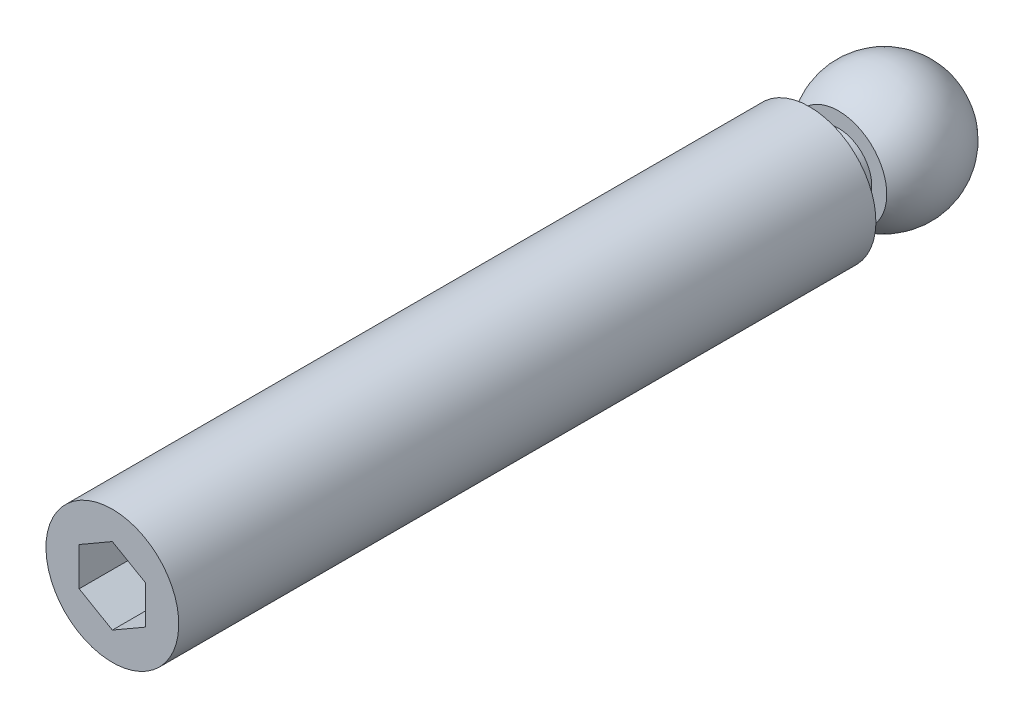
ISO-10303-21;
HEADER;
FILE_DESCRIPTION(('STEP AP214'),'2;1');
FILE_NAME('part.step','',(''),(''),'','','');
FILE_SCHEMA(('AUTOMOTIVE_DESIGN { 1 0 10303 214 1 1 1 1 }'));
ENDSEC;
DATA;
#1=APPLICATION_CONTEXT('core data for automotive mechanical design processes');
#2=APPLICATION_PROTOCOL_DEFINITION('international standard','automotive_design',2000,#1);
#3=PRODUCT_CONTEXT('',#1,'mechanical');
#4=PRODUCT('Part','Part','',(#3));
#5=PRODUCT_RELATED_PRODUCT_CATEGORY('part','',(#4));
#6=PRODUCT_DEFINITION_FORMATION('','',#4);
#7=PRODUCT_DEFINITION_CONTEXT('part definition',#1,'design');
#8=PRODUCT_DEFINITION('design','',#6,#7);
#9=PRODUCT_DEFINITION_SHAPE('','',#8);
#10=(LENGTH_UNIT() NAMED_UNIT(*) SI_UNIT(.MILLI.,.METRE.));
#11=(NAMED_UNIT(*) PLANE_ANGLE_UNIT() SI_UNIT($,.RADIAN.));
#12=(NAMED_UNIT(*) SI_UNIT($,.STERADIAN.) SOLID_ANGLE_UNIT());
#13=UNCERTAINTY_MEASURE_WITH_UNIT(LENGTH_MEASURE(1.E-05),#10,'distance_accuracy_value','');
#14=(GEOMETRIC_REPRESENTATION_CONTEXT(3) GLOBAL_UNCERTAINTY_ASSIGNED_CONTEXT((#13)) GLOBAL_UNIT_ASSIGNED_CONTEXT((#10,
#11,#12)) REPRESENTATION_CONTEXT('',''));
#15=CARTESIAN_POINT('',(0.,0.,0.));
#16=DIRECTION('',(0.,0.,1.));
#17=DIRECTION('',(1.,0.,0.));
#18=AXIS2_PLACEMENT_3D('',#15,#16,#17);
#19=CARTESIAN_POINT('',(0.,0.,8.));
#20=DIRECTION('',(0.,-1.,0.));
#21=DIRECTION('',(-1.,0.,0.));
#22=AXIS2_PLACEMENT_3D('',#19,#20,#21);
#23=SPHERICAL_SURFACE('',#22,8.);
#24=CARTESIAN_POINT('',(0.,0.,8.));
#25=DIRECTION('',(0.,0.,1.));
#26=DIRECTION('',(0.,1.,0.));
#27=AXIS2_PLACEMENT_3D('',#24,#25,#26);
#28=SPHERICAL_SURFACE('',#27,8.);
#29=CARTESIAN_POINT('',(0.,0.,13.5));
#30=DIRECTION('',(0.,0.,1.));
#31=DIRECTION('',(0.,1.,0.));
#32=AXIS2_PLACEMENT_3D('',#29,#30,#31);
#33=CIRCLE('',#32,5.80947501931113);
#34=CARTESIAN_POINT('',(0.,5.80947501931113,13.5));
#35=VERTEX_POINT('',#34);
#36=EDGE_CURVE('E9',#35,#35,#33,.T.);
#37=ORIENTED_EDGE('',*,*,#36,.F.);
#38=EDGE_LOOP('',(#37));
#39=FACE_BOUND('',#38,.T.);
#40=ADVANCED_FACE('F14',(#39),#28,.T.);
#41=CARTESIAN_POINT('',(0.,-5.80947501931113,13.5));
#42=DIRECTION('',(0.,0.,-1.));
#43=DIRECTION('',(0.,-1.,0.));
#44=AXIS2_PLACEMENT_3D('',#41,#42,#43);
#45=PLANE('',#44);
#46=CARTESIAN_POINT('',(0.,0.,13.5));
#47=DIRECTION('',(0.,0.,1.));
#48=DIRECTION('',(0.,1.,0.));
#49=AXIS2_PLACEMENT_3D('',#46,#47,#48);
#50=CIRCLE('',#49,4.);
#51=CARTESIAN_POINT('',(0.,4.,13.5));
#52=VERTEX_POINT('',#51);
#53=EDGE_CURVE('E21',#52,#52,#50,.T.);
#54=ORIENTED_EDGE('',*,*,#53,.F.);
#55=EDGE_LOOP('',(#54));
#56=FACE_BOUND('',#55,.T.);
#57=ORIENTED_EDGE('',*,*,#36,.T.);
#58=EDGE_LOOP('',(#57));
#59=FACE_BOUND('',#58,.T.);
#60=ADVANCED_FACE('F134',(#56,#59),#45,.F.);
#61=CARTESIAN_POINT('',(0.,0.,8.3));
#62=DIRECTION('',(0.,0.,1.));
#63=DIRECTION('',(0.,1.,0.));
#64=AXIS2_PLACEMENT_3D('',#61,#62,#63);
#65=CYLINDRICAL_SURFACE('',#64,4.);
#66=ORIENTED_EDGE('',*,*,#53,.T.);
#67=EDGE_LOOP('',(#66));
#68=FACE_BOUND('',#67,.T.);
#69=CARTESIAN_POINT('',(0.,0.,17.));
#70=DIRECTION('',(0.,0.,1.));
#71=DIRECTION('',(0.,1.,0.));
#72=AXIS2_PLACEMENT_3D('',#69,#70,#71);
#73=CIRCLE('',#72,4.);
#74=CARTESIAN_POINT('',(0.,4.,17.));
#75=VERTEX_POINT('',#74);
#76=EDGE_CURVE('E126',#75,#75,#73,.T.);
#77=ORIENTED_EDGE('',*,*,#76,.F.);
#78=EDGE_LOOP('',(#77));
#79=FACE_BOUND('',#78,.T.);
#80=ADVANCED_FACE('F131',(#68,#79),#65,.T.);
#81=CARTESIAN_POINT('',(0.,-8.,17.));
#82=DIRECTION('',(0.,0.,-1.));
#83=DIRECTION('',(0.,-1.,0.));
#84=AXIS2_PLACEMENT_3D('',#81,#82,#83);
#85=PLANE('',#84);
#86=ORIENTED_EDGE('',*,*,#76,.T.);
#87=EDGE_LOOP('',(#86));
#88=FACE_BOUND('',#87,.T.);
#89=CARTESIAN_POINT('',(0.,0.,17.));
#90=DIRECTION('',(0.,0.,1.));
#91=DIRECTION('',(0.,1.,0.));
#92=AXIS2_PLACEMENT_3D('',#89,#90,#91);
#93=CIRCLE('',#92,8.);
#94=CARTESIAN_POINT('',(0.,8.,17.));
#95=VERTEX_POINT('',#94);
#96=EDGE_CURVE('E123',#95,#95,#93,.T.);
#97=ORIENTED_EDGE('',*,*,#96,.F.);
#98=EDGE_LOOP('',(#97));
#99=FACE_BOUND('',#98,.T.);
#100=ADVANCED_FACE('F157',(#88,#99),#85,.T.);
#101=CARTESIAN_POINT('',(0.,0.,8.3));
#102=DIRECTION('',(0.,0.,1.));
#103=DIRECTION('',(0.,1.,0.));
#104=AXIS2_PLACEMENT_3D('',#101,#102,#103);
#105=CYLINDRICAL_SURFACE('',#104,8.);
#106=ORIENTED_EDGE('',*,*,#96,.T.);
#107=EDGE_LOOP('',(#106));
#108=FACE_BOUND('',#107,.T.);
#109=CARTESIAN_POINT('',(0.,0.,101.));
#110=DIRECTION('',(0.,0.,1.));
#111=DIRECTION('',(0.,1.,0.));
#112=AXIS2_PLACEMENT_3D('',#109,#110,#111);
#113=CIRCLE('',#112,8.);
#114=CARTESIAN_POINT('',(0.,8.,101.));
#115=VERTEX_POINT('',#114);
#116=EDGE_CURVE('E115',#115,#115,#113,.T.);
#117=ORIENTED_EDGE('',*,*,#116,.F.);
#118=EDGE_LOOP('',(#117));
#119=FACE_BOUND('',#118,.T.);
#120=ADVANCED_FACE('F165',(#108,#119),#105,.T.);
#121=CARTESIAN_POINT('',(0.,0.,101.));
#122=DIRECTION('',(0.,0.,1.));
#123=DIRECTION('',(0.,1.,0.));
#124=AXIS2_PLACEMENT_3D('',#121,#122,#123);
#125=PLANE('',#124);
#126=DIRECTION('',(-0.866025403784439,0.5,0.));
#127=VECTOR('',#126,1.);
#128=CARTESIAN_POINT('',(4.,2.30940107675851,101.));
#129=LINE('',#128,#127);
#130=CARTESIAN_POINT('',(4.,2.30940107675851,101.));
#131=VERTEX_POINT('',#130);
#132=CARTESIAN_POINT('',(0.,4.61880215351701,101.));
#133=VERTEX_POINT('',#132);
#134=EDGE_CURVE('E28',#131,#133,#129,.T.);
#135=ORIENTED_EDGE('',*,*,#134,.F.);
#136=DIRECTION('',(0.,1.,0.));
#137=VECTOR('',#136,1.);
#138=CARTESIAN_POINT('',(4.,-2.30940107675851,101.));
#139=LINE('',#138,#137);
#140=CARTESIAN_POINT('',(4.,-2.30940107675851,101.));
#141=VERTEX_POINT('',#140);
#142=EDGE_CURVE('E111',#141,#131,#139,.T.);
#143=ORIENTED_EDGE('',*,*,#142,.F.);
#144=DIRECTION('',(0.866025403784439,0.5,0.));
#145=VECTOR('',#144,1.);
#146=CARTESIAN_POINT('',(0.,-4.61880215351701,101.));
#147=LINE('',#146,#145);
#148=CARTESIAN_POINT('',(0.,-4.61880215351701,101.));
#149=VERTEX_POINT('',#148);
#150=EDGE_CURVE('E109',#149,#141,#147,.T.);
#151=ORIENTED_EDGE('',*,*,#150,.F.);
#152=DIRECTION('',(0.866025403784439,-0.5,0.));
#153=VECTOR('',#152,1.);
#154=CARTESIAN_POINT('',(-4.,-2.30940107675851,101.));
#155=LINE('',#154,#153);
#156=CARTESIAN_POINT('',(-4.,-2.30940107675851,101.));
#157=VERTEX_POINT('',#156);
#158=EDGE_CURVE('E76',#157,#149,#155,.T.);
#159=ORIENTED_EDGE('',*,*,#158,.F.);
#160=DIRECTION('',(0.,-1.,0.));
#161=VECTOR('',#160,1.);
#162=CARTESIAN_POINT('',(-4.,2.30940107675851,101.));
#163=LINE('',#162,#161);
#164=CARTESIAN_POINT('',(-4.,2.30940107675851,101.));
#165=VERTEX_POINT('',#164);
#166=EDGE_CURVE('E105',#165,#157,#163,.T.);
#167=ORIENTED_EDGE('',*,*,#166,.F.);
#168=DIRECTION('',(-0.866025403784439,-0.5,0.));
#169=VECTOR('',#168,1.);
#170=CARTESIAN_POINT('',(0.,4.61880215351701,101.));
#171=LINE('',#170,#169);
#172=EDGE_CURVE('E102',#133,#165,#171,.T.);
#173=ORIENTED_EDGE('',*,*,#172,.F.);
#174=EDGE_LOOP('',(#135,#143,#151,#159,#167,#173));
#175=FACE_BOUND('',#174,.T.);
#176=ORIENTED_EDGE('',*,*,#116,.T.);
#177=EDGE_LOOP('',(#176));
#178=FACE_BOUND('',#177,.T.);
#179=ADVANCED_FACE('F174',(#175,#178),#125,.T.);
#180=CARTESIAN_POINT('',(4.,2.30940107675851,91.));
#181=DIRECTION('',(0.5,0.866025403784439,0.));
#182=DIRECTION('',(-0.866025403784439,0.5,0.));
#183=AXIS2_PLACEMENT_3D('',#180,#181,#182);
#184=PLANE('',#183);
#185=ORIENTED_EDGE('',*,*,#134,.T.);
#186=DIRECTION('',(0.,0.,1.));
#187=VECTOR('',#186,1.);
#188=CARTESIAN_POINT('',(0.,4.61880215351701,91.));
#189=LINE('',#188,#187);
#190=CARTESIAN_POINT('',(0.,4.61880215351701,91.));
#191=VERTEX_POINT('',#190);
#192=EDGE_CURVE('E58',#191,#133,#189,.T.);
#193=ORIENTED_EDGE('',*,*,#192,.F.);
#194=DIRECTION('',(-0.866025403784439,0.5,0.));
#195=VECTOR('',#194,1.);
#196=CARTESIAN_POINT('',(4.,2.30940107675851,91.));
#197=LINE('',#196,#195);
#198=CARTESIAN_POINT('',(4.,2.30940107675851,91.));
#199=VERTEX_POINT('',#198);
#200=EDGE_CURVE('E113',#199,#191,#197,.T.);
#201=ORIENTED_EDGE('',*,*,#200,.F.);
#202=DIRECTION('',(0.,0.,1.));
#203=VECTOR('',#202,1.);
#204=CARTESIAN_POINT('',(4.,2.30940107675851,91.));
#205=LINE('',#204,#203);
#206=EDGE_CURVE('E36',#199,#131,#205,.T.);
#207=ORIENTED_EDGE('',*,*,#206,.T.);
#208=EDGE_LOOP('',(#185,#193,#201,#207));
#209=FACE_BOUND('',#208,.T.);
#210=ADVANCED_FACE('F183',(#209),#184,.F.);
#211=CARTESIAN_POINT('',(4.,-2.30940107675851,91.));
#212=DIRECTION('',(1.,0.,0.));
#213=DIRECTION('',(0.,0.,-1.));
#214=AXIS2_PLACEMENT_3D('',#211,#212,#213);
#215=PLANE('',#214);
#216=ORIENTED_EDGE('',*,*,#142,.T.);
#217=ORIENTED_EDGE('',*,*,#206,.F.);
#218=DIRECTION('',(0.,1.,0.));
#219=VECTOR('',#218,1.);
#220=CARTESIAN_POINT('',(4.,-2.30940107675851,91.));
#221=LINE('',#220,#219);
#222=CARTESIAN_POINT('',(4.,-2.30940107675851,91.));
#223=VERTEX_POINT('',#222);
#224=EDGE_CURVE('E88',#223,#199,#221,.T.);
#225=ORIENTED_EDGE('',*,*,#224,.F.);
#226=DIRECTION('',(0.,0.,1.));
#227=VECTOR('',#226,1.);
#228=CARTESIAN_POINT('',(4.,-2.30940107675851,91.));
#229=LINE('',#228,#227);
#230=EDGE_CURVE('E80',#223,#141,#229,.T.);
#231=ORIENTED_EDGE('',*,*,#230,.T.);
#232=EDGE_LOOP('',(#216,#217,#225,#231));
#233=FACE_BOUND('',#232,.T.);
#234=ADVANCED_FACE('F192',(#233),#215,.F.);
#235=CARTESIAN_POINT('',(0.,-4.61880215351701,91.));
#236=DIRECTION('',(0.5,-0.866025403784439,0.));
#237=DIRECTION('',(0.866025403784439,0.5,0.));
#238=AXIS2_PLACEMENT_3D('',#235,#236,#237);
#239=PLANE('',#238);
#240=ORIENTED_EDGE('',*,*,#150,.T.);
#241=ORIENTED_EDGE('',*,*,#230,.F.);
#242=DIRECTION('',(0.866025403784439,0.5,0.));
#243=VECTOR('',#242,1.);
#244=CARTESIAN_POINT('',(0.,-4.61880215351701,91.));
#245=LINE('',#244,#243);
#246=CARTESIAN_POINT('',(0.,-4.61880215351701,91.));
#247=VERTEX_POINT('',#246);
#248=EDGE_CURVE('E84',#247,#223,#245,.T.);
#249=ORIENTED_EDGE('',*,*,#248,.F.);
#250=DIRECTION('',(0.,0.,1.));
#251=VECTOR('',#250,1.);
#252=CARTESIAN_POINT('',(0.,-4.61880215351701,91.));
#253=LINE('',#252,#251);
#254=EDGE_CURVE('E69',#247,#149,#253,.T.);
#255=ORIENTED_EDGE('',*,*,#254,.T.);
#256=EDGE_LOOP('',(#240,#241,#249,#255));
#257=FACE_BOUND('',#256,.T.);
#258=ADVANCED_FACE('F85',(#257),#239,.F.);
#259=CARTESIAN_POINT('',(-4.,-2.30940107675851,91.));
#260=DIRECTION('',(-0.5,-0.866025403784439,0.));
#261=DIRECTION('',(0.866025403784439,-0.5,0.));
#262=AXIS2_PLACEMENT_3D('',#259,#260,#261);
#263=PLANE('',#262);
#264=ORIENTED_EDGE('',*,*,#158,.T.);
#265=ORIENTED_EDGE('',*,*,#254,.F.);
#266=DIRECTION('',(0.866025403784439,-0.5,0.));
#267=VECTOR('',#266,1.);
#268=CARTESIAN_POINT('',(-4.,-2.30940107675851,91.));
#269=LINE('',#268,#267);
#270=CARTESIAN_POINT('',(-4.,-2.30940107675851,91.));
#271=VERTEX_POINT('',#270);
#272=EDGE_CURVE('E73',#271,#247,#269,.T.);
#273=ORIENTED_EDGE('',*,*,#272,.F.);
#274=DIRECTION('',(0.,0.,1.));
#275=VECTOR('',#274,1.);
#276=CARTESIAN_POINT('',(-4.,-2.30940107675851,91.));
#277=LINE('',#276,#275);
#278=EDGE_CURVE('E81',#271,#157,#277,.T.);
#279=ORIENTED_EDGE('',*,*,#278,.T.);
#280=EDGE_LOOP('',(#264,#265,#273,#279));
#281=FACE_BOUND('',#280,.T.);
#282=ADVANCED_FACE('F71',(#281),#263,.F.);
#283=CARTESIAN_POINT('',(-4.,2.30940107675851,91.));
#284=DIRECTION('',(-1.,0.,0.));
#285=DIRECTION('',(0.,0.,1.));
#286=AXIS2_PLACEMENT_3D('',#283,#284,#285);
#287=PLANE('',#286);
#288=ORIENTED_EDGE('',*,*,#166,.T.);
#289=ORIENTED_EDGE('',*,*,#278,.F.);
#290=DIRECTION('',(0.,-1.,0.));
#291=VECTOR('',#290,1.);
#292=CARTESIAN_POINT('',(-4.,2.30940107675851,91.));
#293=LINE('',#292,#291);
#294=CARTESIAN_POINT('',(-4.,2.30940107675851,91.));
#295=VERTEX_POINT('',#294);
#296=EDGE_CURVE('E94',#295,#271,#293,.T.);
#297=ORIENTED_EDGE('',*,*,#296,.F.);
#298=DIRECTION('',(0.,0.,1.));
#299=VECTOR('',#298,1.);
#300=CARTESIAN_POINT('',(-4.,2.30940107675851,91.));
#301=LINE('',#300,#299);
#302=EDGE_CURVE('E118',#295,#165,#301,.T.);
#303=ORIENTED_EDGE('',*,*,#302,.T.);
#304=EDGE_LOOP('',(#288,#289,#297,#303));
#305=FACE_BOUND('',#304,.T.);
#306=ADVANCED_FACE('F214',(#305),#287,.F.);
#307=CARTESIAN_POINT('',(0.,4.61880215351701,91.));
#308=DIRECTION('',(-0.5,0.866025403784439,0.));
#309=DIRECTION('',(-0.866025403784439,-0.5,0.));
#310=AXIS2_PLACEMENT_3D('',#307,#308,#309);
#311=PLANE('',#310);
#312=ORIENTED_EDGE('',*,*,#172,.T.);
#313=ORIENTED_EDGE('',*,*,#302,.F.);
#314=DIRECTION('',(-0.866025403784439,-0.5,0.));
#315=VECTOR('',#314,1.);
#316=CARTESIAN_POINT('',(0.,4.61880215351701,91.));
#317=LINE('',#316,#315);
#318=EDGE_CURVE('E96',#191,#295,#317,.T.);
#319=ORIENTED_EDGE('',*,*,#318,.F.);
#320=ORIENTED_EDGE('',*,*,#192,.T.);
#321=EDGE_LOOP('',(#312,#313,#319,#320));
#322=FACE_BOUND('',#321,.T.);
#323=ADVANCED_FACE('F222',(#322),#311,.F.);
#324=CARTESIAN_POINT('',(0.,4.61880215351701,91.));
#325=DIRECTION('',(0.,0.,1.));
#326=DIRECTION('',(1.,0.,0.));
#327=AXIS2_PLACEMENT_3D('',#324,#325,#326);
#328=PLANE('',#327);
#329=ORIENTED_EDGE('',*,*,#200,.T.);
#330=ORIENTED_EDGE('',*,*,#318,.T.);
#331=ORIENTED_EDGE('',*,*,#296,.T.);
#332=ORIENTED_EDGE('',*,*,#272,.T.);
#333=ORIENTED_EDGE('',*,*,#248,.T.);
#334=ORIENTED_EDGE('',*,*,#224,.T.);
#335=EDGE_LOOP('',(#329,#330,#331,#332,#333,#334));
#336=FACE_BOUND('',#335,.T.);
#337=ADVANCED_FACE('F91',(#336),#328,.T.);
#338=CLOSED_SHELL('',(#40,#60,#80,#100,#120,#179,#210,#234,#258,#282,#306,#323,#337));
#339=MANIFOLD_SOLID_BREP('B1',#338);
#340=ADVANCED_BREP_SHAPE_REPRESENTATION('',(#18,#339),#14);
#341=SHAPE_DEFINITION_REPRESENTATION(#9,#340);
ENDSEC;
END-ISO-10303-21;
